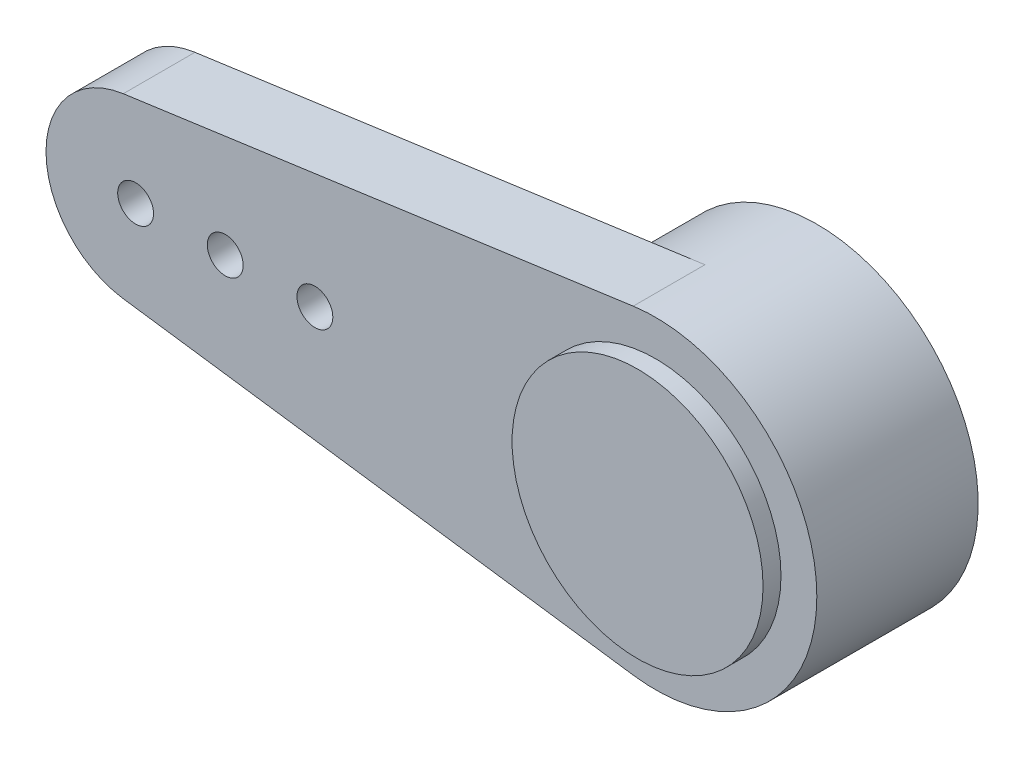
ISO-10303-21;
HEADER;
FILE_DESCRIPTION(('STEP AP214'),'2;1');
FILE_NAME('part.step','',(''),(''),'','','');
FILE_SCHEMA(('AUTOMOTIVE_DESIGN { 1 0 10303 214 1 1 1 1 }'));
ENDSEC;
DATA;
#1=APPLICATION_CONTEXT('core data for automotive mechanical design processes');
#2=APPLICATION_PROTOCOL_DEFINITION('international standard','automotive_design',2000,#1);
#3=PRODUCT_CONTEXT('',#1,'mechanical');
#4=PRODUCT('Part','Part','',(#3));
#5=PRODUCT_RELATED_PRODUCT_CATEGORY('part','',(#4));
#6=PRODUCT_DEFINITION_FORMATION('','',#4);
#7=PRODUCT_DEFINITION_CONTEXT('part definition',#1,'design');
#8=PRODUCT_DEFINITION('design','',#6,#7);
#9=PRODUCT_DEFINITION_SHAPE('','',#8);
#10=(LENGTH_UNIT() NAMED_UNIT(*) SI_UNIT(.MILLI.,.METRE.));
#11=(NAMED_UNIT(*) PLANE_ANGLE_UNIT() SI_UNIT($,.RADIAN.));
#12=(NAMED_UNIT(*) SI_UNIT($,.STERADIAN.) SOLID_ANGLE_UNIT());
#13=UNCERTAINTY_MEASURE_WITH_UNIT(LENGTH_MEASURE(1.E-05),#10,'distance_accuracy_value','');
#14=(GEOMETRIC_REPRESENTATION_CONTEXT(3) GLOBAL_UNCERTAINTY_ASSIGNED_CONTEXT((#13)) GLOBAL_UNIT_ASSIGNED_CONTEXT((#10,
#11,#12)) REPRESENTATION_CONTEXT('',''));
#15=CARTESIAN_POINT('',(0.,0.,0.));
#16=DIRECTION('',(0.,0.,1.));
#17=DIRECTION('',(1.,0.,0.));
#18=AXIS2_PLACEMENT_3D('',#15,#16,#17);
#19=CARTESIAN_POINT('',(0.,0.,0.));
#20=DIRECTION('',(0.,0.,1.));
#21=DIRECTION('',(1.,0.,0.));
#22=AXIS2_PLACEMENT_3D('',#19,#20,#21);
#23=PLANE('',#22);
#24=CARTESIAN_POINT('',(-9.5,0.,0.));
#25=DIRECTION('',(0.,0.,1.));
#26=DIRECTION('',(1.,0.,0.));
#27=AXIS2_PLACEMENT_3D('',#24,#25,#26);
#28=CIRCLE('',#27,0.500000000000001);
#29=CARTESIAN_POINT('',(-9.,0.,0.));
#30=VERTEX_POINT('',#29);
#31=EDGE_CURVE('E130',#30,#30,#28,.T.);
#32=ORIENTED_EDGE('',*,*,#31,.T.);
#33=EDGE_LOOP('',(#32));
#34=FACE_BOUND('',#33,.T.);
#35=CARTESIAN_POINT('',(-14.5,0.,0.));
#36=DIRECTION('',(0.,0.,1.));
#37=DIRECTION('',(1.,0.,0.));
#38=AXIS2_PLACEMENT_3D('',#35,#36,#37);
#39=CIRCLE('',#38,0.500000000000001);
#40=CARTESIAN_POINT('',(-14.,0.,0.));
#41=VERTEX_POINT('',#40);
#42=EDGE_CURVE('E118',#41,#41,#39,.T.);
#43=ORIENTED_EDGE('',*,*,#42,.T.);
#44=EDGE_LOOP('',(#43));
#45=FACE_BOUND('',#44,.T.);
#46=CARTESIAN_POINT('',(-12.,0.,0.));
#47=DIRECTION('',(0.,0.,1.));
#48=DIRECTION('',(1.,0.,0.));
#49=AXIS2_PLACEMENT_3D('',#46,#47,#48);
#50=CIRCLE('',#49,0.500000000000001);
#51=CARTESIAN_POINT('',(-11.5,0.,0.));
#52=VERTEX_POINT('',#51);
#53=EDGE_CURVE('E124',#52,#52,#50,.T.);
#54=ORIENTED_EDGE('',*,*,#53,.T.);
#55=EDGE_LOOP('',(#54));
#56=FACE_BOUND('',#55,.T.);
#57=CARTESIAN_POINT('',(0.,0.,0.));
#58=DIRECTION('',(0.,0.,-1.));
#59=DIRECTION('',(-1.,0.,0.));
#60=AXIS2_PLACEMENT_3D('',#57,#58,#59);
#61=CIRCLE('',#60,4.5);
#62=CARTESIAN_POINT('',(-0.620689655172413,-4.45698826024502,0.));
#63=VERTEX_POINT('',#62);
#64=CARTESIAN_POINT('',(-0.620689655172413,4.45698826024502,0.));
#65=VERTEX_POINT('',#64);
#66=EDGE_CURVE('E11',#63,#65,#61,.T.);
#67=ORIENTED_EDGE('',*,*,#66,.F.);
#68=DIRECTION('',(0.990441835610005,-0.137931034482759,0.));
#69=VECTOR('',#68,1.);
#70=CARTESIAN_POINT('',(-14.8448275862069,-2.47610458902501,0.));
#71=LINE('',#70,#69);
#72=CARTESIAN_POINT('',(-14.8448275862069,-2.47610458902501,0.));
#73=VERTEX_POINT('',#72);
#74=EDGE_CURVE('E105',#73,#63,#71,.T.);
#75=ORIENTED_EDGE('',*,*,#74,.F.);
#76=CARTESIAN_POINT('',(-14.5,0.,0.));
#77=DIRECTION('',(0.,0.,1.));
#78=DIRECTION('',(1.,0.,0.));
#79=AXIS2_PLACEMENT_3D('',#76,#77,#78);
#80=CIRCLE('',#79,2.5);
#81=CARTESIAN_POINT('',(-14.8448275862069,2.47610458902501,0.));
#82=VERTEX_POINT('',#81);
#83=EDGE_CURVE('E68',#82,#73,#80,.T.);
#84=ORIENTED_EDGE('',*,*,#83,.F.);
#85=DIRECTION('',(-0.990441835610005,-0.137931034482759,0.));
#86=VECTOR('',#85,1.);
#87=CARTESIAN_POINT('',(-14.8448275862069,2.47610458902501,0.));
#88=LINE('',#87,#86);
#89=EDGE_CURVE('E86',#65,#82,#88,.T.);
#90=ORIENTED_EDGE('',*,*,#89,.F.);
#91=EDGE_LOOP('',(#67,#75,#84,#90));
#92=FACE_BOUND('',#91,.T.);
#93=ADVANCED_FACE('F34',(#34,#45,#56,#92),#23,.F.);
#94=CARTESIAN_POINT('',(0.,0.,2.));
#95=DIRECTION('',(0.,0.,1.));
#96=DIRECTION('',(1.,0.,0.));
#97=AXIS2_PLACEMENT_3D('',#94,#95,#96);
#98=PLANE('',#97);
#99=CARTESIAN_POINT('',(-9.5,0.,2.));
#100=DIRECTION('',(0.,0.,1.));
#101=DIRECTION('',(1.,0.,0.));
#102=AXIS2_PLACEMENT_3D('',#99,#100,#101);
#103=CIRCLE('',#102,0.500000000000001);
#104=CARTESIAN_POINT('',(-9.,0.,2.));
#105=VERTEX_POINT('',#104);
#106=EDGE_CURVE('E127',#105,#105,#103,.T.);
#107=ORIENTED_EDGE('',*,*,#106,.F.);
#108=EDGE_LOOP('',(#107));
#109=FACE_BOUND('',#108,.T.);
#110=CARTESIAN_POINT('',(-14.5,0.,2.));
#111=DIRECTION('',(0.,0.,1.));
#112=DIRECTION('',(1.,0.,0.));
#113=AXIS2_PLACEMENT_3D('',#110,#111,#112);
#114=CIRCLE('',#113,0.500000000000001);
#115=CARTESIAN_POINT('',(-14.,0.,2.));
#116=VERTEX_POINT('',#115);
#117=EDGE_CURVE('E91',#116,#116,#114,.T.);
#118=ORIENTED_EDGE('',*,*,#117,.F.);
#119=EDGE_LOOP('',(#118));
#120=FACE_BOUND('',#119,.T.);
#121=CARTESIAN_POINT('',(0.,0.,2.));
#122=DIRECTION('',(0.,0.,1.));
#123=DIRECTION('',(1.,0.,0.));
#124=AXIS2_PLACEMENT_3D('',#121,#122,#123);
#125=CIRCLE('',#124,4.5);
#126=CARTESIAN_POINT('',(-0.620689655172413,-4.45698826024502,2.));
#127=VERTEX_POINT('',#126);
#128=CARTESIAN_POINT('',(-0.620689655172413,4.45698826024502,2.));
#129=VERTEX_POINT('',#128);
#130=EDGE_CURVE('E96',#127,#129,#125,.T.);
#131=ORIENTED_EDGE('',*,*,#130,.T.);
#132=DIRECTION('',(-0.990441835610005,-0.137931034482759,0.));
#133=VECTOR('',#132,1.);
#134=CARTESIAN_POINT('',(-14.8448275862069,2.47610458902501,2.));
#135=LINE('',#134,#133);
#136=CARTESIAN_POINT('',(-14.8448275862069,2.47610458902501,2.));
#137=VERTEX_POINT('',#136);
#138=EDGE_CURVE('E82',#129,#137,#135,.T.);
#139=ORIENTED_EDGE('',*,*,#138,.T.);
#140=CARTESIAN_POINT('',(-14.5,0.,2.));
#141=DIRECTION('',(0.,0.,1.));
#142=DIRECTION('',(1.,0.,0.));
#143=AXIS2_PLACEMENT_3D('',#140,#141,#142);
#144=CIRCLE('',#143,2.5);
#145=CARTESIAN_POINT('',(-14.8448275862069,-2.47610458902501,2.));
#146=VERTEX_POINT('',#145);
#147=EDGE_CURVE('E100',#137,#146,#144,.T.);
#148=ORIENTED_EDGE('',*,*,#147,.T.);
#149=DIRECTION('',(0.990441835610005,-0.137931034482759,0.));
#150=VECTOR('',#149,1.);
#151=CARTESIAN_POINT('',(-14.8448275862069,-2.47610458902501,2.));
#152=LINE('',#151,#150);
#153=EDGE_CURVE('E53',#146,#127,#152,.T.);
#154=ORIENTED_EDGE('',*,*,#153,.T.);
#155=EDGE_LOOP('',(#131,#139,#148,#154));
#156=FACE_BOUND('',#155,.T.);
#157=CARTESIAN_POINT('',(-12.,0.,2.));
#158=DIRECTION('',(0.,0.,1.));
#159=DIRECTION('',(1.,0.,0.));
#160=AXIS2_PLACEMENT_3D('',#157,#158,#159);
#161=CIRCLE('',#160,0.500000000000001);
#162=CARTESIAN_POINT('',(-11.5,0.,2.));
#163=VERTEX_POINT('',#162);
#164=EDGE_CURVE('E121',#163,#163,#161,.T.);
#165=ORIENTED_EDGE('',*,*,#164,.F.);
#166=EDGE_LOOP('',(#165));
#167=FACE_BOUND('',#166,.T.);
#168=CARTESIAN_POINT('',(0.,0.,2.));
#169=DIRECTION('',(0.,0.,1.));
#170=DIRECTION('',(1.,0.,0.));
#171=AXIS2_PLACEMENT_3D('',#168,#169,#170);
#172=CIRCLE('',#171,3.5);
#173=CARTESIAN_POINT('',(3.5,0.,2.));
#174=VERTEX_POINT('',#173);
#175=EDGE_CURVE('E136',#174,#174,#172,.T.);
#176=ORIENTED_EDGE('',*,*,#175,.F.);
#177=EDGE_LOOP('',(#176));
#178=FACE_BOUND('',#177,.T.);
#179=ADVANCED_FACE('F166',(#109,#120,#156,#167,#178),#98,.T.);
#180=CARTESIAN_POINT('',(0.,0.,2.));
#181=DIRECTION('',(0.,0.,-1.));
#182=DIRECTION('',(-1.,0.,0.));
#183=AXIS2_PLACEMENT_3D('',#180,#181,#182);
#184=CYLINDRICAL_SURFACE('',#183,4.5);
#185=DIRECTION('',(0.,0.,-1.));
#186=VECTOR('',#185,1.);
#187=CARTESIAN_POINT('',(-0.620689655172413,-4.45698826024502,2.));
#188=LINE('',#187,#186);
#189=EDGE_CURVE('E95',#127,#63,#188,.T.);
#190=ORIENTED_EDGE('',*,*,#189,.T.);
#191=ORIENTED_EDGE('',*,*,#66,.T.);
#192=DIRECTION('',(0.,0.,-1.));
#193=VECTOR('',#192,1.);
#194=CARTESIAN_POINT('',(-0.620689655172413,4.45698826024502,2.));
#195=LINE('',#194,#193);
#196=EDGE_CURVE('E44',#129,#65,#195,.T.);
#197=ORIENTED_EDGE('',*,*,#196,.F.);
#198=ORIENTED_EDGE('',*,*,#130,.F.);
#199=EDGE_LOOP('',(#190,#191,#197,#198));
#200=FACE_BOUND('',#199,.T.);
#201=CARTESIAN_POINT('',(0.,0.,-2.5));
#202=DIRECTION('',(0.,0.,-1.));
#203=DIRECTION('',(-1.,0.,0.));
#204=AXIS2_PLACEMENT_3D('',#201,#202,#203);
#205=CIRCLE('',#204,4.5);
#206=CARTESIAN_POINT('',(-4.5,0.,-2.5));
#207=VERTEX_POINT('',#206);
#208=EDGE_CURVE('E139',#207,#207,#205,.T.);
#209=ORIENTED_EDGE('',*,*,#208,.F.);
#210=EDGE_LOOP('',(#209));
#211=FACE_BOUND('',#210,.T.);
#212=ADVANCED_FACE('F36',(#200,#211),#184,.T.);
#213=CARTESIAN_POINT('',(-14.8448275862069,2.47610458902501,2.));
#214=DIRECTION('',(0.137931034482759,-0.990441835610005,0.));
#215=DIRECTION('',(0.990441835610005,0.137931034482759,0.));
#216=AXIS2_PLACEMENT_3D('',#213,#214,#215);
#217=PLANE('',#216);
#218=ORIENTED_EDGE('',*,*,#89,.T.);
#219=DIRECTION('',(0.,0.,-1.));
#220=VECTOR('',#219,1.);
#221=CARTESIAN_POINT('',(-14.8448275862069,2.47610458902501,2.));
#222=LINE('',#221,#220);
#223=EDGE_CURVE('E89',#137,#82,#222,.T.);
#224=ORIENTED_EDGE('',*,*,#223,.F.);
#225=ORIENTED_EDGE('',*,*,#138,.F.);
#226=ORIENTED_EDGE('',*,*,#196,.T.);
#227=EDGE_LOOP('',(#218,#224,#225,#226));
#228=FACE_BOUND('',#227,.T.);
#229=ADVANCED_FACE('F85',(#228),#217,.F.);
#230=CARTESIAN_POINT('',(-14.5,0.,2.));
#231=DIRECTION('',(0.,0.,-1.));
#232=DIRECTION('',(-1.,0.,0.));
#233=AXIS2_PLACEMENT_3D('',#230,#231,#232);
#234=CYLINDRICAL_SURFACE('',#233,2.5);
#235=ORIENTED_EDGE('',*,*,#83,.T.);
#236=DIRECTION('',(0.,0.,-1.));
#237=VECTOR('',#236,1.);
#238=CARTESIAN_POINT('',(-14.8448275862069,-2.47610458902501,2.));
#239=LINE('',#238,#237);
#240=EDGE_CURVE('E98',#146,#73,#239,.T.);
#241=ORIENTED_EDGE('',*,*,#240,.F.);
#242=ORIENTED_EDGE('',*,*,#147,.F.);
#243=ORIENTED_EDGE('',*,*,#223,.T.);
#244=EDGE_LOOP('',(#235,#241,#242,#243));
#245=FACE_BOUND('',#244,.T.);
#246=ADVANCED_FACE('F171',(#245),#234,.T.);
#247=CARTESIAN_POINT('',(-14.8448275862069,-2.47610458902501,2.));
#248=DIRECTION('',(0.137931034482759,0.990441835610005,0.));
#249=DIRECTION('',(-0.990441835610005,0.137931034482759,0.));
#250=AXIS2_PLACEMENT_3D('',#247,#248,#249);
#251=PLANE('',#250);
#252=ORIENTED_EDGE('',*,*,#74,.T.);
#253=ORIENTED_EDGE('',*,*,#189,.F.);
#254=ORIENTED_EDGE('',*,*,#153,.F.);
#255=ORIENTED_EDGE('',*,*,#240,.T.);
#256=EDGE_LOOP('',(#252,#253,#254,#255));
#257=FACE_BOUND('',#256,.T.);
#258=ADVANCED_FACE('F182',(#257),#251,.F.);
#259=CARTESIAN_POINT('',(-14.5,0.,2.));
#260=DIRECTION('',(0.,0.,-1.));
#261=DIRECTION('',(-1.,0.,0.));
#262=AXIS2_PLACEMENT_3D('',#259,#260,#261);
#263=CYLINDRICAL_SURFACE('',#262,0.500000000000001);
#264=ORIENTED_EDGE('',*,*,#117,.T.);
#265=EDGE_LOOP('',(#264));
#266=FACE_BOUND('',#265,.T.);
#267=ORIENTED_EDGE('',*,*,#42,.F.);
#268=EDGE_LOOP('',(#267));
#269=FACE_BOUND('',#268,.T.);
#270=ADVANCED_FACE('F185',(#266,#269),#263,.F.);
#271=CARTESIAN_POINT('',(-12.,0.,2.));
#272=DIRECTION('',(0.,0.,-1.));
#273=DIRECTION('',(-1.,0.,0.));
#274=AXIS2_PLACEMENT_3D('',#271,#272,#273);
#275=CYLINDRICAL_SURFACE('',#274,0.500000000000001);
#276=ORIENTED_EDGE('',*,*,#164,.T.);
#277=EDGE_LOOP('',(#276));
#278=FACE_BOUND('',#277,.T.);
#279=ORIENTED_EDGE('',*,*,#53,.F.);
#280=EDGE_LOOP('',(#279));
#281=FACE_BOUND('',#280,.T.);
#282=ADVANCED_FACE('F202',(#278,#281),#275,.F.);
#283=CARTESIAN_POINT('',(-9.5,0.,2.));
#284=DIRECTION('',(0.,0.,-1.));
#285=DIRECTION('',(-1.,0.,0.));
#286=AXIS2_PLACEMENT_3D('',#283,#284,#285);
#287=CYLINDRICAL_SURFACE('',#286,0.500000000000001);
#288=ORIENTED_EDGE('',*,*,#106,.T.);
#289=EDGE_LOOP('',(#288));
#290=FACE_BOUND('',#289,.T.);
#291=ORIENTED_EDGE('',*,*,#31,.F.);
#292=EDGE_LOOP('',(#291));
#293=FACE_BOUND('',#292,.T.);
#294=ADVANCED_FACE('F209',(#290,#293),#287,.F.);
#295=CARTESIAN_POINT('',(0.,0.,2.5));
#296=DIRECTION('',(0.,0.,-1.));
#297=DIRECTION('',(-1.,0.,0.));
#298=AXIS2_PLACEMENT_3D('',#295,#296,#297);
#299=CYLINDRICAL_SURFACE('',#298,3.5);
#300=CARTESIAN_POINT('',(0.,0.,2.5));
#301=DIRECTION('',(0.,0.,1.));
#302=DIRECTION('',(1.,0.,0.));
#303=AXIS2_PLACEMENT_3D('',#300,#301,#302);
#304=CIRCLE('',#303,3.5);
#305=CARTESIAN_POINT('',(3.5,0.,2.5));
#306=VERTEX_POINT('',#305);
#307=EDGE_CURVE('E133',#306,#306,#304,.T.);
#308=ORIENTED_EDGE('',*,*,#307,.F.);
#309=EDGE_LOOP('',(#308));
#310=FACE_BOUND('',#309,.T.);
#311=ORIENTED_EDGE('',*,*,#175,.T.);
#312=EDGE_LOOP('',(#311));
#313=FACE_BOUND('',#312,.T.);
#314=ADVANCED_FACE('F217',(#310,#313),#299,.T.);
#315=CARTESIAN_POINT('',(0.,0.,2.5));
#316=DIRECTION('',(0.,0.,1.));
#317=DIRECTION('',(1.,0.,0.));
#318=AXIS2_PLACEMENT_3D('',#315,#316,#317);
#319=PLANE('',#318);
#320=ORIENTED_EDGE('',*,*,#307,.T.);
#321=EDGE_LOOP('',(#320));
#322=FACE_BOUND('',#321,.T.);
#323=ADVANCED_FACE('F162',(#322),#319,.T.);
#324=CARTESIAN_POINT('',(0.,0.,-2.5));
#325=DIRECTION('',(0.,0.,-1.));
#326=DIRECTION('',(-1.,0.,0.));
#327=AXIS2_PLACEMENT_3D('',#324,#325,#326);
#328=PLANE('',#327);
#329=CARTESIAN_POINT('',(0.,0.,-2.5));
#330=DIRECTION('',(0.,0.,-1.));
#331=DIRECTION('',(-1.,0.,0.));
#332=AXIS2_PLACEMENT_3D('',#329,#330,#331);
#333=CIRCLE('',#332,2.9);
#334=CARTESIAN_POINT('',(-2.9,0.,-2.5));
#335=VERTEX_POINT('',#334);
#336=EDGE_CURVE('E145',#335,#335,#333,.T.);
#337=ORIENTED_EDGE('',*,*,#336,.F.);
#338=EDGE_LOOP('',(#337));
#339=FACE_BOUND('',#338,.T.);
#340=ORIENTED_EDGE('',*,*,#208,.T.);
#341=EDGE_LOOP('',(#340));
#342=FACE_BOUND('',#341,.T.);
#343=ADVANCED_FACE('F156',(#339,#342),#328,.T.);
#344=CARTESIAN_POINT('',(0.,0.,0.2));
#345=DIRECTION('',(0.,0.,-1.));
#346=DIRECTION('',(-1.,0.,0.));
#347=AXIS2_PLACEMENT_3D('',#344,#345,#346);
#348=CYLINDRICAL_SURFACE('',#347,2.9);
#349=CARTESIAN_POINT('',(0.,0.,0.2));
#350=DIRECTION('',(0.,0.,-1.));
#351=DIRECTION('',(-1.,0.,0.));
#352=AXIS2_PLACEMENT_3D('',#349,#350,#351);
#353=CIRCLE('',#352,2.9);
#354=CARTESIAN_POINT('',(-2.9,0.,0.2));
#355=VERTEX_POINT('',#354);
#356=EDGE_CURVE('E144',#355,#355,#353,.T.);
#357=CARTESIAN_POINT('',(-2.9,0.,0.2));
#358=CARTESIAN_POINT('',(-2.9,0.,0.171875));
#359=CARTESIAN_POINT('',(-2.9,0.,0.14375));
#360=CARTESIAN_POINT('',(-2.9,0.,0.0875000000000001));
#361=CARTESIAN_POINT('',(-2.9,0.,0.0593750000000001));
#362=CARTESIAN_POINT('',(-2.9,0.,0.00312500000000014));
#363=CARTESIAN_POINT('',(-2.9,0.,-0.0249999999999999));
#364=CARTESIAN_POINT('',(-2.9,0.,-0.0812499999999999));
#365=CARTESIAN_POINT('',(-2.9,0.,-0.109375));
#366=CARTESIAN_POINT('',(-2.9,0.,-0.165625));
#367=CARTESIAN_POINT('',(-2.9,0.,-0.19375));
#368=CARTESIAN_POINT('',(-2.9,0.,-0.25));
#369=CARTESIAN_POINT('',(-2.9,0.,-0.278125));
#370=CARTESIAN_POINT('',(-2.9,0.,-0.334375));
#371=CARTESIAN_POINT('',(-2.9,0.,-0.3625));
#372=CARTESIAN_POINT('',(-2.9,0.,-0.41875));
#373=CARTESIAN_POINT('',(-2.9,0.,-0.446875));
#374=CARTESIAN_POINT('',(-2.9,0.,-0.503125));
#375=CARTESIAN_POINT('',(-2.9,0.,-0.53125));
#376=CARTESIAN_POINT('',(-2.9,0.,-0.5875));
#377=CARTESIAN_POINT('',(-2.9,0.,-0.615625));
#378=CARTESIAN_POINT('',(-2.9,0.,-0.671875));
#379=CARTESIAN_POINT('',(-2.9,0.,-0.7));
#380=CARTESIAN_POINT('',(-2.9,0.,-0.75625));
#381=CARTESIAN_POINT('',(-2.9,0.,-0.784375));
#382=CARTESIAN_POINT('',(-2.9,0.,-0.840625));
#383=CARTESIAN_POINT('',(-2.9,0.,-0.86875));
#384=CARTESIAN_POINT('',(-2.9,0.,-0.925));
#385=CARTESIAN_POINT('',(-2.9,0.,-0.953125));
#386=CARTESIAN_POINT('',(-2.9,0.,-1.009375));
#387=CARTESIAN_POINT('',(-2.9,0.,-1.0375));
#388=CARTESIAN_POINT('',(-2.9,0.,-1.09375));
#389=CARTESIAN_POINT('',(-2.9,0.,-1.121875));
#390=CARTESIAN_POINT('',(-2.9,0.,-1.178125));
#391=CARTESIAN_POINT('',(-2.9,0.,-1.20625));
#392=CARTESIAN_POINT('',(-2.9,0.,-1.2625));
#393=CARTESIAN_POINT('',(-2.9,0.,-1.290625));
#394=CARTESIAN_POINT('',(-2.9,0.,-1.346875));
#395=CARTESIAN_POINT('',(-2.9,0.,-1.375));
#396=CARTESIAN_POINT('',(-2.9,0.,-1.43125));
#397=CARTESIAN_POINT('',(-2.9,0.,-1.459375));
#398=CARTESIAN_POINT('',(-2.9,0.,-1.515625));
#399=CARTESIAN_POINT('',(-2.9,0.,-1.54375));
#400=CARTESIAN_POINT('',(-2.9,0.,-1.6));
#401=CARTESIAN_POINT('',(-2.9,0.,-1.628125));
#402=CARTESIAN_POINT('',(-2.9,0.,-1.684375));
#403=CARTESIAN_POINT('',(-2.9,0.,-1.7125));
#404=CARTESIAN_POINT('',(-2.9,0.,-1.76875));
#405=CARTESIAN_POINT('',(-2.9,0.,-1.796875));
#406=CARTESIAN_POINT('',(-2.9,0.,-1.853125));
#407=CARTESIAN_POINT('',(-2.9,0.,-1.88125));
#408=CARTESIAN_POINT('',(-2.9,0.,-1.9375));
#409=CARTESIAN_POINT('',(-2.9,0.,-1.965625));
#410=CARTESIAN_POINT('',(-2.9,0.,-2.021875));
#411=CARTESIAN_POINT('',(-2.9,0.,-2.05));
#412=CARTESIAN_POINT('',(-2.9,0.,-2.10625));
#413=CARTESIAN_POINT('',(-2.9,0.,-2.134375));
#414=CARTESIAN_POINT('',(-2.9,0.,-2.190625));
#415=CARTESIAN_POINT('',(-2.9,0.,-2.21875));
#416=CARTESIAN_POINT('',(-2.9,0.,-2.275));
#417=CARTESIAN_POINT('',(-2.9,0.,-2.303125));
#418=CARTESIAN_POINT('',(-2.9,0.,-2.359375));
#419=CARTESIAN_POINT('',(-2.9,0.,-2.3875));
#420=CARTESIAN_POINT('',(-2.9,0.,-2.44375));
#421=CARTESIAN_POINT('',(-2.9,0.,-2.471875));
#422=CARTESIAN_POINT('',(-2.9,0.,-2.5));
#423=B_SPLINE_CURVE_WITH_KNOTS('',3,(#357,#358,#359,#360,#361,#362,#363,#364,#365,#366,#367,
#368,#369,#370,#371,#372,#373,#374,#375,#376,#377,#378,#379,#380,#381,#382,#383,#384,#385,#386,
#387,#388,#389,#390,#391,#392,#393,#394,#395,#396,#397,#398,#399,#400,#401,#402,#403,#404,#405,
#406,#407,#408,#409,#410,#411,#412,#413,#414,#415,#416,#417,#418,#419,#420,#421,#422),
.UNSPECIFIED.,.F.,.F.,(4,2,2,2,2,2,2,2,2,2,2,2,2,2,2,2,2,2,2,2,2,2,2,2,2,2,2,2,2,2,2,2,4),(0.,
0.084375,0.16875,0.253125,0.3375,0.421875,0.50625,0.590625,0.675,0.759375,0.84375,0.928125,
1.0125,1.096875,1.18125,1.265625,1.35,1.434375,1.51875,1.603125,1.6875,1.771875,1.85625,
1.940625,2.025,2.109375,2.19375,2.278125,2.3625,2.446875,2.53125,2.615625,2.7),.UNSPECIFIED.);
#424=EDGE_CURVE('BSEAM153',#355,#335,#423,.T.);
#425=ORIENTED_EDGE('',*,*,#356,.F.);
#426=ORIENTED_EDGE('',*,*,#336,.T.);
#427=ORIENTED_EDGE('',*,*,#424,.T.);
#428=ORIENTED_EDGE('',*,*,#424,.F.);
#429=EDGE_LOOP('',(#425,#427,#426,#428));
#430=FACE_BOUND('',#429,.T.);
#431=ADVANCED_FACE('F153',(#430),#348,.F.);
#432=CARTESIAN_POINT('',(0.,0.,0.2));
#433=DIRECTION('',(0.,0.,-1.));
#434=DIRECTION('',(-1.,0.,0.));
#435=AXIS2_PLACEMENT_3D('',#432,#433,#434);
#436=PLANE('',#435);
#437=ORIENTED_EDGE('',*,*,#356,.T.);
#438=EDGE_LOOP('',(#437));
#439=FACE_BOUND('',#438,.T.);
#440=ADVANCED_FACE('F151',(#439),#436,.T.);
#441=CLOSED_SHELL('',(#93,#179,#212,#229,#246,#258,#270,#282,#294,#314,#323,#343,#431,#440));
#442=MANIFOLD_SOLID_BREP('B2',#441);
#443=ADVANCED_BREP_SHAPE_REPRESENTATION('',(#18,#442),#14);
#444=SHAPE_DEFINITION_REPRESENTATION(#9,#443);
ENDSEC;
END-ISO-10303-21;
